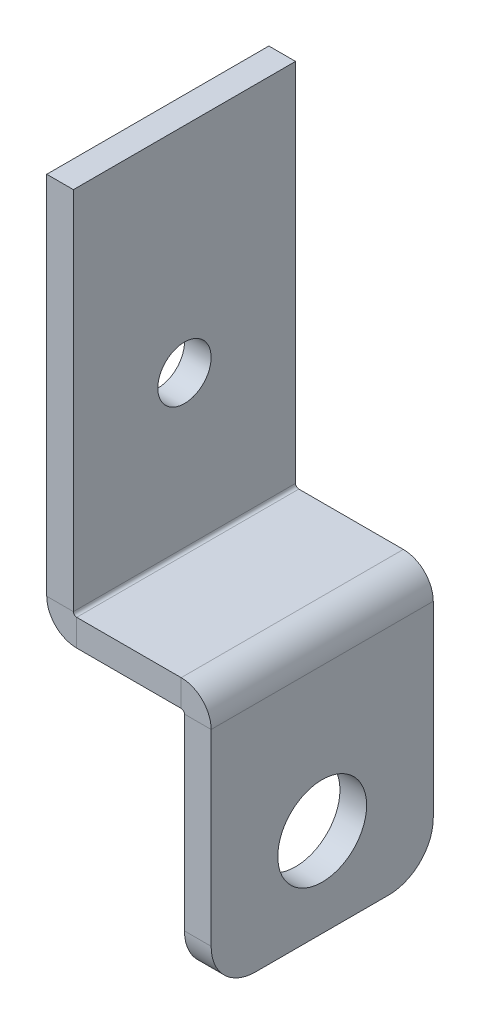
ISO-10303-21;
HEADER;
FILE_DESCRIPTION(('STEP AP214'),'2;1');
FILE_NAME('part.step','',(''),(''),'','','');
FILE_SCHEMA(('AUTOMOTIVE_DESIGN { 1 0 10303 214 1 1 1 1 }'));
ENDSEC;
DATA;
#1=APPLICATION_CONTEXT('core data for automotive mechanical design processes');
#2=APPLICATION_PROTOCOL_DEFINITION('international standard','automotive_design',2000,#1);
#3=PRODUCT_CONTEXT('',#1,'mechanical');
#4=PRODUCT('Part','Part','',(#3));
#5=PRODUCT_RELATED_PRODUCT_CATEGORY('part','',(#4));
#6=PRODUCT_DEFINITION_FORMATION('','',#4);
#7=PRODUCT_DEFINITION_CONTEXT('part definition',#1,'design');
#8=PRODUCT_DEFINITION('design','',#6,#7);
#9=PRODUCT_DEFINITION_SHAPE('','',#8);
#10=(LENGTH_UNIT() NAMED_UNIT(*) SI_UNIT(.MILLI.,.METRE.));
#11=(NAMED_UNIT(*) PLANE_ANGLE_UNIT() SI_UNIT($,.RADIAN.));
#12=(NAMED_UNIT(*) SI_UNIT($,.STERADIAN.) SOLID_ANGLE_UNIT());
#13=UNCERTAINTY_MEASURE_WITH_UNIT(LENGTH_MEASURE(1.E-05),#10,'distance_accuracy_value','');
#14=(GEOMETRIC_REPRESENTATION_CONTEXT(3) GLOBAL_UNCERTAINTY_ASSIGNED_CONTEXT((#13)) GLOBAL_UNIT_ASSIGNED_CONTEXT((#10,
#11,#12)) REPRESENTATION_CONTEXT('',''));
#15=CARTESIAN_POINT('',(0.,0.,0.));
#16=DIRECTION('',(0.,0.,1.));
#17=DIRECTION('',(1.,0.,0.));
#18=AXIS2_PLACEMENT_3D('',#15,#16,#17);
#19=CARTESIAN_POINT('',(5.99999999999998,-40.8,25.));
#20=DIRECTION('',(0.,0.,-1.));
#21=DIRECTION('',(-1.,0.,0.));
#22=AXIS2_PLACEMENT_3D('',#19,#20,#21);
#23=PLANE('',#22);
#24=DIRECTION('',(0.,1.,0.));
#25=VECTOR('',#24,1.);
#26=CARTESIAN_POINT('',(30.2634,-40.8000000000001,25.));
#27=LINE('',#26,#25);
#28=CARTESIAN_POINT('',(30.2634,-40.8000000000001,25.));
#29=VERTEX_POINT('',#28);
#30=CARTESIAN_POINT('',(30.2634,-34.8000000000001,25.));
#31=VERTEX_POINT('',#30);
#32=EDGE_CURVE('E180',#29,#31,#27,.T.);
#33=ORIENTED_EDGE('',*,*,#32,.T.);
#34=DIRECTION('',(-1.,0.,0.));
#35=VECTOR('',#34,1.);
#36=CARTESIAN_POINT('',(6.,-34.8,25.));
#37=LINE('',#36,#35);
#38=CARTESIAN_POINT('',(6.7366,-34.8,25.));
#39=VERTEX_POINT('',#38);
#40=EDGE_CURVE('E197',#31,#39,#37,.T.);
#41=ORIENTED_EDGE('',*,*,#40,.T.);
#42=DIRECTION('',(0.,-1.,0.));
#43=VECTOR('',#42,1.);
#44=CARTESIAN_POINT('',(6.7366,-34.8,25.));
#45=LINE('',#44,#43);
#46=CARTESIAN_POINT('',(6.73659999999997,-40.8,25.));
#47=VERTEX_POINT('',#46);
#48=EDGE_CURVE('E185',#39,#47,#45,.T.);
#49=ORIENTED_EDGE('',*,*,#48,.T.);
#50=DIRECTION('',(-1.,0.,0.));
#51=VECTOR('',#50,1.);
#52=CARTESIAN_POINT('',(5.99999999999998,-40.8,25.));
#53=LINE('',#52,#51);
#54=EDGE_CURVE('E202',#29,#47,#53,.T.);
#55=ORIENTED_EDGE('',*,*,#54,.F.);
#56=EDGE_LOOP('',(#33,#41,#49,#55));
#57=FACE_BOUND('',#56,.T.);
#58=ADVANCED_FACE('F32',(#57),#23,.F.);
#59=CARTESIAN_POINT('',(31.,-40.8000000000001,-25.));
#60=DIRECTION('',(0.,0.,1.));
#61=DIRECTION('',(1.,0.,0.));
#62=AXIS2_PLACEMENT_3D('',#59,#60,#61);
#63=PLANE('',#62);
#64=DIRECTION('',(0.,1.,0.));
#65=VECTOR('',#64,1.);
#66=CARTESIAN_POINT('',(30.2634,-40.8000000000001,-25.));
#67=LINE('',#66,#65);
#68=CARTESIAN_POINT('',(30.2634,-40.8000000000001,-25.));
#69=VERTEX_POINT('',#68);
#70=CARTESIAN_POINT('',(30.2634,-34.8000000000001,-25.));
#71=VERTEX_POINT('',#70);
#72=EDGE_CURVE('E182',#69,#71,#67,.T.);
#73=ORIENTED_EDGE('',*,*,#72,.F.);
#74=DIRECTION('',(1.,0.,0.));
#75=VECTOR('',#74,1.);
#76=CARTESIAN_POINT('',(31.,-40.8000000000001,-25.));
#77=LINE('',#76,#75);
#78=CARTESIAN_POINT('',(6.73659999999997,-40.8,-25.));
#79=VERTEX_POINT('',#78);
#80=EDGE_CURVE('E204',#79,#69,#77,.T.);
#81=ORIENTED_EDGE('',*,*,#80,.F.);
#82=DIRECTION('',(0.,-1.,0.));
#83=VECTOR('',#82,1.);
#84=CARTESIAN_POINT('',(6.7366,-34.8,-25.));
#85=LINE('',#84,#83);
#86=CARTESIAN_POINT('',(6.7366,-34.8,-25.));
#87=VERTEX_POINT('',#86);
#88=EDGE_CURVE('E189',#87,#79,#85,.T.);
#89=ORIENTED_EDGE('',*,*,#88,.F.);
#90=DIRECTION('',(1.,0.,0.));
#91=VECTOR('',#90,1.);
#92=CARTESIAN_POINT('',(31.,-34.8000000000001,-25.));
#93=LINE('',#92,#91);
#94=EDGE_CURVE('E199',#87,#71,#93,.T.);
#95=ORIENTED_EDGE('',*,*,#94,.T.);
#96=EDGE_LOOP('',(#73,#81,#89,#95));
#97=FACE_BOUND('',#96,.T.);
#98=ADVANCED_FACE('F311',(#97),#63,.F.);
#99=CARTESIAN_POINT('',(31.,-40.8000000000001,25.));
#100=DIRECTION('',(0.,1.,0.));
#101=DIRECTION('',(-1.,0.,0.));
#102=AXIS2_PLACEMENT_3D('',#99,#100,#101);
#103=PLANE('',#102);
#104=DIRECTION('',(0.,0.,1.));
#105=VECTOR('',#104,1.);
#106=CARTESIAN_POINT('',(30.2634,-40.8000000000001,25.));
#107=LINE('',#106,#105);
#108=EDGE_CURVE('E175',#29,#69,#107,.F.);
#109=ORIENTED_EDGE('',*,*,#108,.F.);
#110=ORIENTED_EDGE('',*,*,#54,.T.);
#111=DIRECTION('',(0.,0.,1.));
#112=VECTOR('',#111,1.);
#113=CARTESIAN_POINT('',(6.73659999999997,-40.8,25.));
#114=LINE('',#113,#112);
#115=EDGE_CURVE('E192',#79,#47,#114,.T.);
#116=ORIENTED_EDGE('',*,*,#115,.F.);
#117=ORIENTED_EDGE('',*,*,#80,.T.);
#118=EDGE_LOOP('',(#109,#110,#116,#117));
#119=FACE_BOUND('',#118,.T.);
#120=ADVANCED_FACE('F317',(#119),#103,.F.);
#121=CARTESIAN_POINT('',(31.,-34.8000000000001,25.));
#122=DIRECTION('',(0.,1.,0.));
#123=DIRECTION('',(-1.,0.,0.));
#124=AXIS2_PLACEMENT_3D('',#121,#122,#123);
#125=PLANE('',#124);
#126=ORIENTED_EDGE('',*,*,#40,.F.);
#127=DIRECTION('',(0.,0.,1.));
#128=VECTOR('',#127,1.);
#129=CARTESIAN_POINT('',(30.2634,-34.8000000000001,25.));
#130=LINE('',#129,#128);
#131=EDGE_CURVE('E143',#31,#71,#130,.F.);
#132=ORIENTED_EDGE('',*,*,#131,.T.);
#133=ORIENTED_EDGE('',*,*,#94,.F.);
#134=DIRECTION('',(0.,0.,-1.));
#135=VECTOR('',#134,1.);
#136=CARTESIAN_POINT('',(6.7366,-34.8,25.));
#137=LINE('',#136,#135);
#138=EDGE_CURVE('E187',#39,#87,#137,.T.);
#139=ORIENTED_EDGE('',*,*,#138,.F.);
#140=EDGE_LOOP('',(#126,#132,#133,#139));
#141=FACE_BOUND('',#140,.T.);
#142=ADVANCED_FACE('F351',(#141),#125,.T.);
#143=CARTESIAN_POINT('',(6.,48.2,25.));
#144=DIRECTION('',(1.,0.,0.));
#145=DIRECTION('',(0.,0.,-1.));
#146=AXIS2_PLACEMENT_3D('',#143,#144,#145);
#147=PLANE('',#146);
#148=CARTESIAN_POINT('',(6.,0.,0.));
#149=DIRECTION('',(1.,0.,0.));
#150=DIRECTION('',(0.,0.,-1.));
#151=AXIS2_PLACEMENT_3D('',#148,#149,#150);
#152=CIRCLE('',#151,6.);
#153=CARTESIAN_POINT('',(6.,0.,-6.));
#154=VERTEX_POINT('',#153);
#155=EDGE_CURVE('E233',#154,#154,#152,.T.);
#156=ORIENTED_EDGE('',*,*,#155,.F.);
#157=EDGE_LOOP('',(#156));
#158=FACE_BOUND('',#157,.T.);
#159=DIRECTION('',(0.,-1.,0.));
#160=VECTOR('',#159,1.);
#161=CARTESIAN_POINT('',(6.,48.2,25.));
#162=LINE('',#161,#160);
#163=CARTESIAN_POINT('',(6.,48.2,25.));
#164=VERTEX_POINT('',#163);
#165=CARTESIAN_POINT('',(6.,-34.0634,25.));
#166=VERTEX_POINT('',#165);
#167=EDGE_CURVE('E243',#164,#166,#162,.T.);
#168=ORIENTED_EDGE('',*,*,#167,.T.);
#169=DIRECTION('',(0.,0.,-1.));
#170=VECTOR('',#169,1.);
#171=CARTESIAN_POINT('',(6.,-34.0634,-25.));
#172=LINE('',#171,#170);
#173=CARTESIAN_POINT('',(6.,-34.0634,-25.));
#174=VERTEX_POINT('',#173);
#175=EDGE_CURVE('E212',#174,#166,#172,.F.);
#176=ORIENTED_EDGE('',*,*,#175,.F.);
#177=DIRECTION('',(0.,1.,0.));
#178=VECTOR('',#177,1.);
#179=CARTESIAN_POINT('',(6.,48.2,-25.));
#180=LINE('',#179,#178);
#181=CARTESIAN_POINT('',(6.,48.2,-25.));
#182=VERTEX_POINT('',#181);
#183=EDGE_CURVE('E246',#174,#182,#180,.T.);
#184=ORIENTED_EDGE('',*,*,#183,.T.);
#185=DIRECTION('',(0.,0.,1.));
#186=VECTOR('',#185,1.);
#187=CARTESIAN_POINT('',(6.,48.2,25.));
#188=LINE('',#187,#186);
#189=EDGE_CURVE('E248',#182,#164,#188,.T.);
#190=ORIENTED_EDGE('',*,*,#189,.T.);
#191=EDGE_LOOP('',(#168,#176,#184,#190));
#192=FACE_BOUND('',#191,.T.);
#193=ADVANCED_FACE('F347',(#158,#192),#147,.T.);
#194=CARTESIAN_POINT('',(0.,48.2,25.));
#195=DIRECTION('',(1.,0.,0.));
#196=DIRECTION('',(0.,0.,-1.));
#197=AXIS2_PLACEMENT_3D('',#194,#195,#196);
#198=PLANE('',#197);
#199=CARTESIAN_POINT('',(0.,0.,0.));
#200=DIRECTION('',(1.,0.,0.));
#201=DIRECTION('',(0.,0.,-1.));
#202=AXIS2_PLACEMENT_3D('',#199,#200,#201);
#203=CIRCLE('',#202,6.);
#204=CARTESIAN_POINT('',(0.,0.,-6.));
#205=VERTEX_POINT('',#204);
#206=EDGE_CURVE('E228',#205,#205,#203,.T.);
#207=ORIENTED_EDGE('',*,*,#206,.T.);
#208=EDGE_LOOP('',(#207));
#209=FACE_BOUND('',#208,.T.);
#210=DIRECTION('',(0.,0.,-1.));
#211=VECTOR('',#210,1.);
#212=CARTESIAN_POINT('',(0.,-34.0634,-25.));
#213=LINE('',#212,#211);
#214=CARTESIAN_POINT('',(0.,-34.0634,-25.));
#215=VERTEX_POINT('',#214);
#216=CARTESIAN_POINT('',(0.,-34.0634,25.));
#217=VERTEX_POINT('',#216);
#218=EDGE_CURVE('E217',#215,#217,#213,.F.);
#219=ORIENTED_EDGE('',*,*,#218,.T.);
#220=DIRECTION('',(0.,-1.,0.));
#221=VECTOR('',#220,1.);
#222=CARTESIAN_POINT('',(0.,48.2,25.));
#223=LINE('',#222,#221);
#224=CARTESIAN_POINT('',(0.,48.2,25.));
#225=VERTEX_POINT('',#224);
#226=EDGE_CURVE('E236',#225,#217,#223,.T.);
#227=ORIENTED_EDGE('',*,*,#226,.F.);
#228=DIRECTION('',(0.,0.,1.));
#229=VECTOR('',#228,1.);
#230=CARTESIAN_POINT('',(0.,48.2,25.));
#231=LINE('',#230,#229);
#232=CARTESIAN_POINT('',(0.,48.2,-25.));
#233=VERTEX_POINT('',#232);
#234=EDGE_CURVE('E241',#233,#225,#231,.T.);
#235=ORIENTED_EDGE('',*,*,#234,.F.);
#236=DIRECTION('',(0.,1.,0.));
#237=VECTOR('',#236,1.);
#238=CARTESIAN_POINT('',(0.,48.2,-25.));
#239=LINE('',#238,#237);
#240=EDGE_CURVE('E239',#215,#233,#239,.T.);
#241=ORIENTED_EDGE('',*,*,#240,.F.);
#242=EDGE_LOOP('',(#219,#227,#235,#241));
#243=FACE_BOUND('',#242,.T.);
#244=ADVANCED_FACE('F344',(#209,#243),#198,.F.);
#245=CARTESIAN_POINT('',(6.,48.2,25.));
#246=DIRECTION('',(0.,0.,-1.));
#247=DIRECTION('',(0.,1.,0.));
#248=AXIS2_PLACEMENT_3D('',#245,#246,#247);
#249=PLANE('',#248);
#250=DIRECTION('',(-1.,0.,0.));
#251=VECTOR('',#250,1.);
#252=CARTESIAN_POINT('',(6.,-34.0634,25.));
#253=LINE('',#252,#251);
#254=EDGE_CURVE('E225',#166,#217,#253,.T.);
#255=ORIENTED_EDGE('',*,*,#254,.F.);
#256=ORIENTED_EDGE('',*,*,#167,.F.);
#257=DIRECTION('',(-1.,0.,0.));
#258=VECTOR('',#257,1.);
#259=CARTESIAN_POINT('',(6.,48.2,25.));
#260=LINE('',#259,#258);
#261=EDGE_CURVE('E250',#164,#225,#260,.T.);
#262=ORIENTED_EDGE('',*,*,#261,.T.);
#263=ORIENTED_EDGE('',*,*,#226,.T.);
#264=EDGE_LOOP('',(#255,#256,#262,#263));
#265=FACE_BOUND('',#264,.T.);
#266=ADVANCED_FACE('F34',(#265),#249,.F.);
#267=CARTESIAN_POINT('',(6.,48.2,-25.));
#268=DIRECTION('',(0.,0.,1.));
#269=DIRECTION('',(0.,-1.,0.));
#270=AXIS2_PLACEMENT_3D('',#267,#268,#269);
#271=PLANE('',#270);
#272=DIRECTION('',(-1.,0.,0.));
#273=VECTOR('',#272,1.);
#274=CARTESIAN_POINT('',(6.,-34.0634,-25.));
#275=LINE('',#274,#273);
#276=EDGE_CURVE('E222',#174,#215,#275,.T.);
#277=ORIENTED_EDGE('',*,*,#276,.T.);
#278=ORIENTED_EDGE('',*,*,#240,.T.);
#279=DIRECTION('',(-1.,0.,0.));
#280=VECTOR('',#279,1.);
#281=CARTESIAN_POINT('',(6.,48.2,-25.));
#282=LINE('',#281,#280);
#283=EDGE_CURVE('E253',#182,#233,#282,.T.);
#284=ORIENTED_EDGE('',*,*,#283,.F.);
#285=ORIENTED_EDGE('',*,*,#183,.F.);
#286=EDGE_LOOP('',(#277,#278,#284,#285));
#287=FACE_BOUND('',#286,.T.);
#288=ADVANCED_FACE('F354',(#287),#271,.F.);
#289=CARTESIAN_POINT('',(6.,48.2,25.));
#290=DIRECTION('',(0.,-1.,0.));
#291=DIRECTION('',(0.,0.,-1.));
#292=AXIS2_PLACEMENT_3D('',#289,#290,#291);
#293=PLANE('',#292);
#294=ORIENTED_EDGE('',*,*,#234,.T.);
#295=ORIENTED_EDGE('',*,*,#261,.F.);
#296=ORIENTED_EDGE('',*,*,#189,.F.);
#297=ORIENTED_EDGE('',*,*,#283,.T.);
#298=EDGE_LOOP('',(#294,#295,#296,#297));
#299=FACE_BOUND('',#298,.T.);
#300=ADVANCED_FACE('F342',(#299),#293,.F.);
#301=CARTESIAN_POINT('',(6.,0.,0.));
#302=DIRECTION('',(-1.,0.,0.));
#303=DIRECTION('',(0.,0.,1.));
#304=AXIS2_PLACEMENT_3D('',#301,#302,#303);
#305=CYLINDRICAL_SURFACE('',#304,6.);
#306=ORIENTED_EDGE('',*,*,#155,.T.);
#307=EDGE_LOOP('',(#306));
#308=FACE_BOUND('',#307,.T.);
#309=ORIENTED_EDGE('',*,*,#206,.F.);
#310=EDGE_LOOP('',(#309));
#311=FACE_BOUND('',#310,.T.);
#312=ADVANCED_FACE('F335',(#308,#311),#305,.F.);
#313=CARTESIAN_POINT('',(6.7366,-34.0634,25.));
#314=DIRECTION('',(0.,0.,1.));
#315=DIRECTION('',(1.,0.,0.));
#316=AXIS2_PLACEMENT_3D('',#313,#314,#315);
#317=PLANE('',#316);
#318=ORIENTED_EDGE('',*,*,#48,.F.);
#319=CARTESIAN_POINT('',(6.7366,-34.0634,25.));
#320=DIRECTION('',(0.,0.,-1.));
#321=DIRECTION('',(-1.,0.,0.));
#322=AXIS2_PLACEMENT_3D('',#319,#320,#321);
#323=CIRCLE('',#322,0.736599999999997);
#324=EDGE_CURVE('E208',#166,#39,#323,.F.);
#325=ORIENTED_EDGE('',*,*,#324,.F.);
#326=ORIENTED_EDGE('',*,*,#254,.T.);
#327=CARTESIAN_POINT('',(6.7366,-34.0634,25.));
#328=DIRECTION('',(0.,0.,-1.));
#329=DIRECTION('',(-1.,0.,0.));
#330=AXIS2_PLACEMENT_3D('',#327,#328,#329);
#331=CIRCLE('',#330,6.7366);
#332=EDGE_CURVE('E219',#217,#47,#331,.F.);
#333=ORIENTED_EDGE('',*,*,#332,.T.);
#334=EDGE_LOOP('',(#318,#325,#326,#333));
#335=FACE_BOUND('',#334,.T.);
#336=ADVANCED_FACE('F332',(#335),#317,.T.);
#337=CARTESIAN_POINT('',(6.7366,-34.0634,-25.));
#338=DIRECTION('',(0.,0.,1.));
#339=DIRECTION('',(1.,0.,0.));
#340=AXIS2_PLACEMENT_3D('',#337,#338,#339);
#341=PLANE('',#340);
#342=CARTESIAN_POINT('',(6.7366,-34.0634,-25.));
#343=DIRECTION('',(0.,0.,-1.));
#344=DIRECTION('',(-1.,0.,0.));
#345=AXIS2_PLACEMENT_3D('',#342,#343,#344);
#346=CIRCLE('',#345,0.736599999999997);
#347=EDGE_CURVE('E207',#87,#174,#346,.T.);
#348=ORIENTED_EDGE('',*,*,#347,.F.);
#349=ORIENTED_EDGE('',*,*,#88,.T.);
#350=CARTESIAN_POINT('',(6.7366,-34.0634,-25.));
#351=DIRECTION('',(0.,0.,-1.));
#352=DIRECTION('',(-1.,0.,0.));
#353=AXIS2_PLACEMENT_3D('',#350,#351,#352);
#354=CIRCLE('',#353,6.7366);
#355=EDGE_CURVE('E211',#79,#215,#354,.T.);
#356=ORIENTED_EDGE('',*,*,#355,.T.);
#357=ORIENTED_EDGE('',*,*,#276,.F.);
#358=EDGE_LOOP('',(#348,#349,#356,#357));
#359=FACE_BOUND('',#358,.T.);
#360=ADVANCED_FACE('F328',(#359),#341,.F.);
#361=CARTESIAN_POINT('',(6.7366,-34.0634,-25.));
#362=DIRECTION('',(0.,0.,-1.));
#363=DIRECTION('',(0.,-1.,0.));
#364=AXIS2_PLACEMENT_3D('',#361,#362,#363);
#365=CYLINDRICAL_SURFACE('',#364,6.7366);
#366=ORIENTED_EDGE('',*,*,#218,.F.);
#367=ORIENTED_EDGE('',*,*,#355,.F.);
#368=ORIENTED_EDGE('',*,*,#115,.T.);
#369=ORIENTED_EDGE('',*,*,#332,.F.);
#370=EDGE_LOOP('',(#366,#367,#368,#369));
#371=FACE_BOUND('',#370,.T.);
#372=ADVANCED_FACE('F326',(#371),#365,.T.);
#373=CARTESIAN_POINT('',(6.7366,-34.0634,-25.));
#374=DIRECTION('',(0.,0.,-1.));
#375=DIRECTION('',(0.,-1.,0.));
#376=AXIS2_PLACEMENT_3D('',#373,#374,#375);
#377=CYLINDRICAL_SURFACE('',#376,0.736599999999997);
#378=ORIENTED_EDGE('',*,*,#175,.T.);
#379=ORIENTED_EDGE('',*,*,#324,.T.);
#380=ORIENTED_EDGE('',*,*,#138,.T.);
#381=ORIENTED_EDGE('',*,*,#347,.T.);
#382=EDGE_LOOP('',(#378,#379,#380,#381));
#383=FACE_BOUND('',#382,.T.);
#384=ADVANCED_FACE('F322',(#383),#377,.F.);
#385=CARTESIAN_POINT('',(30.2634,-41.5366000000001,-25.));
#386=DIRECTION('',(0.,0.,-1.));
#387=DIRECTION('',(-1.,0.,0.));
#388=AXIS2_PLACEMENT_3D('',#385,#386,#387);
#389=PLANE('',#388);
#390=DIRECTION('',(1.,0.,0.));
#391=VECTOR('',#390,1.);
#392=CARTESIAN_POINT('',(31.,-41.5366000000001,-25.));
#393=LINE('',#392,#391);
#394=CARTESIAN_POINT('',(31.,-41.5366000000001,-25.));
#395=VERTEX_POINT('',#394);
#396=CARTESIAN_POINT('',(37.,-41.5366000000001,-25.));
#397=VERTEX_POINT('',#396);
#398=EDGE_CURVE('E277',#395,#397,#393,.T.);
#399=ORIENTED_EDGE('',*,*,#398,.F.);
#400=CARTESIAN_POINT('',(30.2634,-41.5366000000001,-25.));
#401=DIRECTION('',(0.,0.,1.));
#402=DIRECTION('',(1.,0.,0.));
#403=AXIS2_PLACEMENT_3D('',#400,#401,#402);
#404=CIRCLE('',#403,0.736599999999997);
#405=EDGE_CURVE('E146',#69,#395,#404,.F.);
#406=ORIENTED_EDGE('',*,*,#405,.F.);
#407=ORIENTED_EDGE('',*,*,#72,.T.);
#408=CARTESIAN_POINT('',(30.2634,-41.5366000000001,-25.));
#409=DIRECTION('',(0.,0.,1.));
#410=DIRECTION('',(1.,0.,0.));
#411=AXIS2_PLACEMENT_3D('',#408,#409,#410);
#412=CIRCLE('',#411,6.7366);
#413=EDGE_CURVE('E179',#71,#397,#412,.F.);
#414=ORIENTED_EDGE('',*,*,#413,.T.);
#415=EDGE_LOOP('',(#399,#406,#407,#414));
#416=FACE_BOUND('',#415,.T.);
#417=ADVANCED_FACE('F325',(#416),#389,.T.);
#418=CARTESIAN_POINT('',(30.2634,-41.5366000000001,25.));
#419=DIRECTION('',(0.,0.,-1.));
#420=DIRECTION('',(-1.,0.,0.));
#421=AXIS2_PLACEMENT_3D('',#418,#419,#420);
#422=PLANE('',#421);
#423=CARTESIAN_POINT('',(30.2634,-41.5366000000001,25.));
#424=DIRECTION('',(0.,0.,1.));
#425=DIRECTION('',(1.,0.,0.));
#426=AXIS2_PLACEMENT_3D('',#423,#424,#425);
#427=CIRCLE('',#426,0.736599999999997);
#428=CARTESIAN_POINT('',(31.,-41.5366000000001,25.));
#429=VERTEX_POINT('',#428);
#430=EDGE_CURVE('E153',#429,#29,#427,.T.);
#431=ORIENTED_EDGE('',*,*,#430,.F.);
#432=DIRECTION('',(1.,0.,0.));
#433=VECTOR('',#432,1.);
#434=CARTESIAN_POINT('',(31.,-41.5366000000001,25.));
#435=LINE('',#434,#433);
#436=CARTESIAN_POINT('',(37.,-41.5366000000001,25.));
#437=VERTEX_POINT('',#436);
#438=EDGE_CURVE('E150',#429,#437,#435,.T.);
#439=ORIENTED_EDGE('',*,*,#438,.T.);
#440=CARTESIAN_POINT('',(30.2634,-41.5366000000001,25.));
#441=DIRECTION('',(0.,0.,1.));
#442=DIRECTION('',(1.,0.,0.));
#443=AXIS2_PLACEMENT_3D('',#440,#441,#442);
#444=CIRCLE('',#443,6.7366);
#445=EDGE_CURVE('E136',#437,#31,#444,.T.);
#446=ORIENTED_EDGE('',*,*,#445,.T.);
#447=ORIENTED_EDGE('',*,*,#32,.F.);
#448=EDGE_LOOP('',(#431,#439,#446,#447));
#449=FACE_BOUND('',#448,.T.);
#450=ADVANCED_FACE('F151',(#449),#422,.F.);
#451=CARTESIAN_POINT('',(30.2634,-41.5366000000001,25.));
#452=DIRECTION('',(0.,0.,1.));
#453=DIRECTION('',(1.,0.,0.));
#454=AXIS2_PLACEMENT_3D('',#451,#452,#453);
#455=CYLINDRICAL_SURFACE('',#454,6.7366);
#456=ORIENTED_EDGE('',*,*,#131,.F.);
#457=ORIENTED_EDGE('',*,*,#445,.F.);
#458=DIRECTION('',(0.,0.,-1.));
#459=VECTOR('',#458,1.);
#460=CARTESIAN_POINT('',(37.,-41.5366000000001,-25.));
#461=LINE('',#460,#459);
#462=EDGE_CURVE('E140',#437,#397,#461,.T.);
#463=ORIENTED_EDGE('',*,*,#462,.T.);
#464=ORIENTED_EDGE('',*,*,#413,.F.);
#465=EDGE_LOOP('',(#456,#457,#463,#464));
#466=FACE_BOUND('',#465,.T.);
#467=ADVANCED_FACE('F138',(#466),#455,.T.);
#468=CARTESIAN_POINT('',(30.2634,-41.5366000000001,25.));
#469=DIRECTION('',(0.,0.,1.));
#470=DIRECTION('',(1.,0.,0.));
#471=AXIS2_PLACEMENT_3D('',#468,#469,#470);
#472=CYLINDRICAL_SURFACE('',#471,0.736599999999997);
#473=ORIENTED_EDGE('',*,*,#108,.T.);
#474=ORIENTED_EDGE('',*,*,#405,.T.);
#475=DIRECTION('',(0.,0.,1.));
#476=VECTOR('',#475,1.);
#477=CARTESIAN_POINT('',(31.,-41.5366000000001,-25.));
#478=LINE('',#477,#476);
#479=EDGE_CURVE('E155',#395,#429,#478,.T.);
#480=ORIENTED_EDGE('',*,*,#479,.T.);
#481=ORIENTED_EDGE('',*,*,#430,.T.);
#482=EDGE_LOOP('',(#473,#474,#480,#481));
#483=FACE_BOUND('',#482,.T.);
#484=ADVANCED_FACE('F391',(#483),#472,.F.);
#485=CARTESIAN_POINT('',(37.,-40.8000000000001,-25.));
#486=DIRECTION('',(0.,0.,1.));
#487=DIRECTION('',(1.,0.,0.));
#488=AXIS2_PLACEMENT_3D('',#485,#486,#487);
#489=PLANE('',#488);
#490=DIRECTION('',(0.,1.,0.));
#491=VECTOR('',#490,1.);
#492=CARTESIAN_POINT('',(37.,-40.8000000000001,-25.));
#493=LINE('',#492,#491);
#494=CARTESIAN_POINT('',(37.,-83.8000000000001,-25.));
#495=VERTEX_POINT('',#494);
#496=EDGE_CURVE('E162',#495,#397,#493,.T.);
#497=ORIENTED_EDGE('',*,*,#496,.F.);
#498=DIRECTION('',(-1.,0.,0.));
#499=VECTOR('',#498,1.);
#500=CARTESIAN_POINT('',(37.,-83.8000000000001,-25.));
#501=LINE('',#500,#499);
#502=CARTESIAN_POINT('',(31.,-83.8000000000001,-25.));
#503=VERTEX_POINT('',#502);
#504=EDGE_CURVE('E256',#495,#503,#501,.T.);
#505=ORIENTED_EDGE('',*,*,#504,.T.);
#506=DIRECTION('',(0.,1.,0.));
#507=VECTOR('',#506,1.);
#508=CARTESIAN_POINT('',(31.,-40.8000000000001,-25.));
#509=LINE('',#508,#507);
#510=EDGE_CURVE('E163',#503,#395,#509,.T.);
#511=ORIENTED_EDGE('',*,*,#510,.T.);
#512=ORIENTED_EDGE('',*,*,#398,.T.);
#513=EDGE_LOOP('',(#497,#505,#511,#512));
#514=FACE_BOUND('',#513,.T.);
#515=ADVANCED_FACE('F274',(#514),#489,.F.);
#516=CARTESIAN_POINT('',(37.,-93.8000000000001,25.));
#517=DIRECTION('',(0.,0.,-1.));
#518=DIRECTION('',(-1.,0.,0.));
#519=AXIS2_PLACEMENT_3D('',#516,#517,#518);
#520=PLANE('',#519);
#521=DIRECTION('',(0.,-1.,0.));
#522=VECTOR('',#521,1.);
#523=CARTESIAN_POINT('',(31.,-93.8000000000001,25.));
#524=LINE('',#523,#522);
#525=CARTESIAN_POINT('',(31.,-83.8000000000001,25.));
#526=VERTEX_POINT('',#525);
#527=EDGE_CURVE('E285',#429,#526,#524,.T.);
#528=ORIENTED_EDGE('',*,*,#527,.T.);
#529=DIRECTION('',(-1.,0.,0.));
#530=VECTOR('',#529,1.);
#531=CARTESIAN_POINT('',(37.,-83.8000000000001,25.));
#532=LINE('',#531,#530);
#533=CARTESIAN_POINT('',(37.,-83.8000000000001,25.));
#534=VERTEX_POINT('',#533);
#535=EDGE_CURVE('E11',#526,#534,#532,.F.);
#536=ORIENTED_EDGE('',*,*,#535,.T.);
#537=DIRECTION('',(0.,-1.,0.));
#538=VECTOR('',#537,1.);
#539=CARTESIAN_POINT('',(37.,-93.8000000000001,25.));
#540=LINE('',#539,#538);
#541=EDGE_CURVE('E159',#437,#534,#540,.T.);
#542=ORIENTED_EDGE('',*,*,#541,.F.);
#543=ORIENTED_EDGE('',*,*,#438,.F.);
#544=EDGE_LOOP('',(#528,#536,#542,#543));
#545=FACE_BOUND('',#544,.T.);
#546=ADVANCED_FACE('F165',(#545),#520,.F.);
#547=CARTESIAN_POINT('',(37.,-93.8000000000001,-25.));
#548=DIRECTION('',(-1.,0.,0.));
#549=DIRECTION('',(0.,-1.,0.));
#550=AXIS2_PLACEMENT_3D('',#547,#548,#549);
#551=PLANE('',#550);
#552=CARTESIAN_POINT('',(37.,-73.8000000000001,0.));
#553=DIRECTION('',(1.,0.,0.));
#554=DIRECTION('',(0.,0.,-1.));
#555=AXIS2_PLACEMENT_3D('',#552,#553,#554);
#556=CIRCLE('',#555,9.99999999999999);
#557=CARTESIAN_POINT('',(37.,-73.8000000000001,-9.99999999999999));
#558=VERTEX_POINT('',#557);
#559=EDGE_CURVE('E291',#558,#558,#556,.T.);
#560=ORIENTED_EDGE('',*,*,#559,.F.);
#561=EDGE_LOOP('',(#560));
#562=FACE_BOUND('',#561,.T.);
#563=DIRECTION('',(0.,0.,-1.));
#564=VECTOR('',#563,1.);
#565=CARTESIAN_POINT('',(37.,-93.8000000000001,-25.));
#566=LINE('',#565,#564);
#567=CARTESIAN_POINT('',(37.,-93.8000000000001,15.));
#568=VERTEX_POINT('',#567);
#569=CARTESIAN_POINT('',(37.,-93.8000000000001,-15.));
#570=VERTEX_POINT('',#569);
#571=EDGE_CURVE('E166',#568,#570,#566,.T.);
#572=ORIENTED_EDGE('',*,*,#571,.T.);
#573=CARTESIAN_POINT('',(37.,-83.8000000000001,-15.));
#574=DIRECTION('',(-1.,0.,0.));
#575=DIRECTION('',(0.,-1.,0.));
#576=AXIS2_PLACEMENT_3D('',#573,#574,#575);
#577=CIRCLE('',#576,10.);
#578=EDGE_CURVE('E41',#570,#495,#577,.F.);
#579=ORIENTED_EDGE('',*,*,#578,.T.);
#580=ORIENTED_EDGE('',*,*,#496,.T.);
#581=ORIENTED_EDGE('',*,*,#462,.F.);
#582=ORIENTED_EDGE('',*,*,#541,.T.);
#583=CARTESIAN_POINT('',(37.,-83.8000000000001,15.));
#584=DIRECTION('',(-1.,0.,0.));
#585=DIRECTION('',(0.,-1.,0.));
#586=AXIS2_PLACEMENT_3D('',#583,#584,#585);
#587=CIRCLE('',#586,10.);
#588=EDGE_CURVE('E267',#534,#568,#587,.F.);
#589=ORIENTED_EDGE('',*,*,#588,.T.);
#590=EDGE_LOOP('',(#572,#579,#580,#581,#582,#589));
#591=FACE_BOUND('',#590,.T.);
#592=ADVANCED_FACE('F158',(#562,#591),#551,.F.);
#593=CARTESIAN_POINT('',(31.,-93.8000000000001,-25.));
#594=DIRECTION('',(-1.,0.,0.));
#595=DIRECTION('',(0.,-1.,0.));
#596=AXIS2_PLACEMENT_3D('',#593,#594,#595);
#597=PLANE('',#596);
#598=CARTESIAN_POINT('',(31.,-73.8000000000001,0.));
#599=DIRECTION('',(-1.,0.,0.));
#600=DIRECTION('',(0.,-1.,0.));
#601=AXIS2_PLACEMENT_3D('',#598,#599,#600);
#602=CIRCLE('',#601,9.99999999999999);
#603=CARTESIAN_POINT('',(31.,-83.8000000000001,0.));
#604=VERTEX_POINT('',#603);
#605=EDGE_CURVE('E36',#604,#604,#602,.T.);
#606=ORIENTED_EDGE('',*,*,#605,.F.);
#607=EDGE_LOOP('',(#606));
#608=FACE_BOUND('',#607,.T.);
#609=ORIENTED_EDGE('',*,*,#510,.F.);
#610=CARTESIAN_POINT('',(31.,-83.8000000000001,-15.));
#611=DIRECTION('',(-1.,0.,0.));
#612=DIRECTION('',(0.,-1.,0.));
#613=AXIS2_PLACEMENT_3D('',#610,#611,#612);
#614=CIRCLE('',#613,10.);
#615=CARTESIAN_POINT('',(31.,-93.8000000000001,-15.));
#616=VERTEX_POINT('',#615);
#617=EDGE_CURVE('E261',#503,#616,#614,.T.);
#618=ORIENTED_EDGE('',*,*,#617,.T.);
#619=DIRECTION('',(0.,0.,-1.));
#620=VECTOR('',#619,1.);
#621=CARTESIAN_POINT('',(31.,-93.8000000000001,-25.));
#622=LINE('',#621,#620);
#623=CARTESIAN_POINT('',(31.,-93.8000000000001,15.));
#624=VERTEX_POINT('',#623);
#625=EDGE_CURVE('E169',#624,#616,#622,.T.);
#626=ORIENTED_EDGE('',*,*,#625,.F.);
#627=CARTESIAN_POINT('',(31.,-83.8000000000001,15.));
#628=DIRECTION('',(-1.,0.,0.));
#629=DIRECTION('',(0.,-1.,0.));
#630=AXIS2_PLACEMENT_3D('',#627,#628,#629);
#631=CIRCLE('',#630,10.);
#632=EDGE_CURVE('E259',#624,#526,#631,.T.);
#633=ORIENTED_EDGE('',*,*,#632,.T.);
#634=ORIENTED_EDGE('',*,*,#527,.F.);
#635=ORIENTED_EDGE('',*,*,#479,.F.);
#636=EDGE_LOOP('',(#609,#618,#626,#633,#634,#635));
#637=FACE_BOUND('',#636,.T.);
#638=ADVANCED_FACE('F281',(#608,#637),#597,.T.);
#639=CARTESIAN_POINT('',(37.,-93.8000000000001,-25.));
#640=DIRECTION('',(0.,1.,0.));
#641=DIRECTION('',(-1.,0.,0.));
#642=AXIS2_PLACEMENT_3D('',#639,#640,#641);
#643=PLANE('',#642);
#644=ORIENTED_EDGE('',*,*,#625,.T.);
#645=DIRECTION('',(-1.,0.,0.));
#646=VECTOR('',#645,1.);
#647=CARTESIAN_POINT('',(37.,-93.8000000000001,-15.));
#648=LINE('',#647,#646);
#649=EDGE_CURVE('E54',#616,#570,#648,.F.);
#650=ORIENTED_EDGE('',*,*,#649,.T.);
#651=ORIENTED_EDGE('',*,*,#571,.F.);
#652=DIRECTION('',(-1.,0.,0.));
#653=VECTOR('',#652,1.);
#654=CARTESIAN_POINT('',(37.,-93.8000000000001,15.));
#655=LINE('',#654,#653);
#656=EDGE_CURVE('E263',#568,#624,#655,.T.);
#657=ORIENTED_EDGE('',*,*,#656,.T.);
#658=EDGE_LOOP('',(#644,#650,#651,#657));
#659=FACE_BOUND('',#658,.T.);
#660=ADVANCED_FACE('F283',(#659),#643,.F.);
#661=CARTESIAN_POINT('',(37.,-83.8000000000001,-15.));
#662=DIRECTION('',(-1.,0.,0.));
#663=DIRECTION('',(0.,-1.,0.));
#664=AXIS2_PLACEMENT_3D('',#661,#662,#663);
#665=CYLINDRICAL_SURFACE('',#664,10.);
#666=ORIENTED_EDGE('',*,*,#578,.F.);
#667=ORIENTED_EDGE('',*,*,#649,.F.);
#668=ORIENTED_EDGE('',*,*,#617,.F.);
#669=ORIENTED_EDGE('',*,*,#504,.F.);
#670=EDGE_LOOP('',(#666,#667,#668,#669));
#671=FACE_BOUND('',#670,.T.);
#672=ADVANCED_FACE('F278',(#671),#665,.T.);
#673=CARTESIAN_POINT('',(37.,-83.8000000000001,15.));
#674=DIRECTION('',(-1.,0.,0.));
#675=DIRECTION('',(0.,-1.,0.));
#676=AXIS2_PLACEMENT_3D('',#673,#674,#675);
#677=CYLINDRICAL_SURFACE('',#676,10.);
#678=ORIENTED_EDGE('',*,*,#588,.F.);
#679=ORIENTED_EDGE('',*,*,#535,.F.);
#680=ORIENTED_EDGE('',*,*,#632,.F.);
#681=ORIENTED_EDGE('',*,*,#656,.F.);
#682=EDGE_LOOP('',(#678,#679,#680,#681));
#683=FACE_BOUND('',#682,.T.);
#684=ADVANCED_FACE('F393',(#683),#677,.T.);
#685=CARTESIAN_POINT('',(37.,-73.8000000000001,0.));
#686=DIRECTION('',(1.,0.,0.));
#687=DIRECTION('',(0.,0.,-1.));
#688=AXIS2_PLACEMENT_3D('',#685,#686,#687);
#689=CYLINDRICAL_SURFACE('',#688,9.99999999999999);
#690=ORIENTED_EDGE('',*,*,#605,.T.);
#691=EDGE_LOOP('',(#690));
#692=FACE_BOUND('',#691,.T.);
#693=ORIENTED_EDGE('',*,*,#559,.T.);
#694=EDGE_LOOP('',(#693));
#695=FACE_BOUND('',#694,.T.);
#696=ADVANCED_FACE('F298',(#692,#695),#689,.F.);
#697=CLOSED_SHELL('',(#58,#98,#120,#142,#193,#244,#266,#288,#300,#312,#336,#360,#372,#384,#417,
#450,#467,#484,#515,#546,#592,#638,#660,#672,#684,#696));
#698=MANIFOLD_SOLID_BREP('B2',#697);
#699=ADVANCED_BREP_SHAPE_REPRESENTATION('',(#18,#698),#14);
#700=SHAPE_DEFINITION_REPRESENTATION(#9,#699);
ENDSEC;
END-ISO-10303-21;
